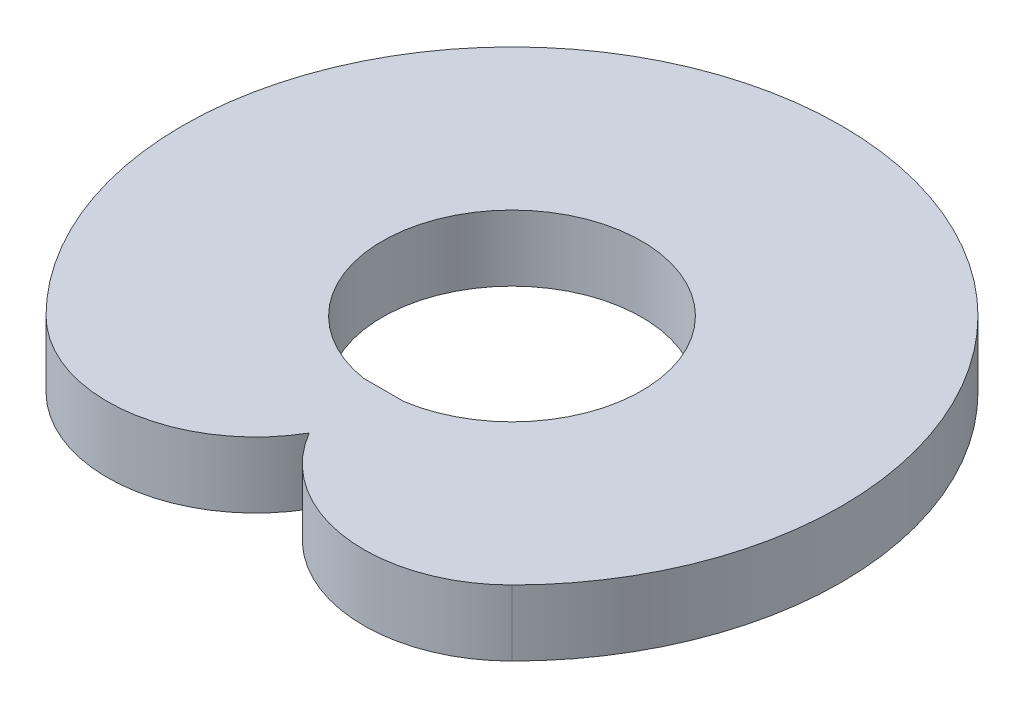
from build123d import *

# Parameters (mm, degrees)
EXTRUDE_1_DEPTH = 200


with BuildPart() as part:
    # Sketch 1 → Extrude 1 (new body)
    with BuildSketch(Plane(origin=(0, 0, 0), x_dir=(1, 0, 0), z_dir=(0, 1, 0))):
        with BuildLine():
            ThreePointArc((707.106781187, -707.106781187), (0, 1000), (-707.106781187, -707.106781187))
            ThreePointArc((-707.106781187, -707.106781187), (-330.965428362, -835.162663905), (0, -615.293358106))
            ThreePointArc((0, -615.293358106), (330.965428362, -835.162663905), (707.106781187, -707.106781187))
        make_face()
        with BuildLine():
            Line((61.091270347, -388.908729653), (-61.091270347, -388.908729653))
            ThreePointArc((-61.091270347, -388.908729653), (0, 393.677715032), (61.091270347, -388.908729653))
        make_face(mode=Mode.SUBTRACT)
    extrude(amount=EXTRUDE_1_DEPTH)


solid = part.part
